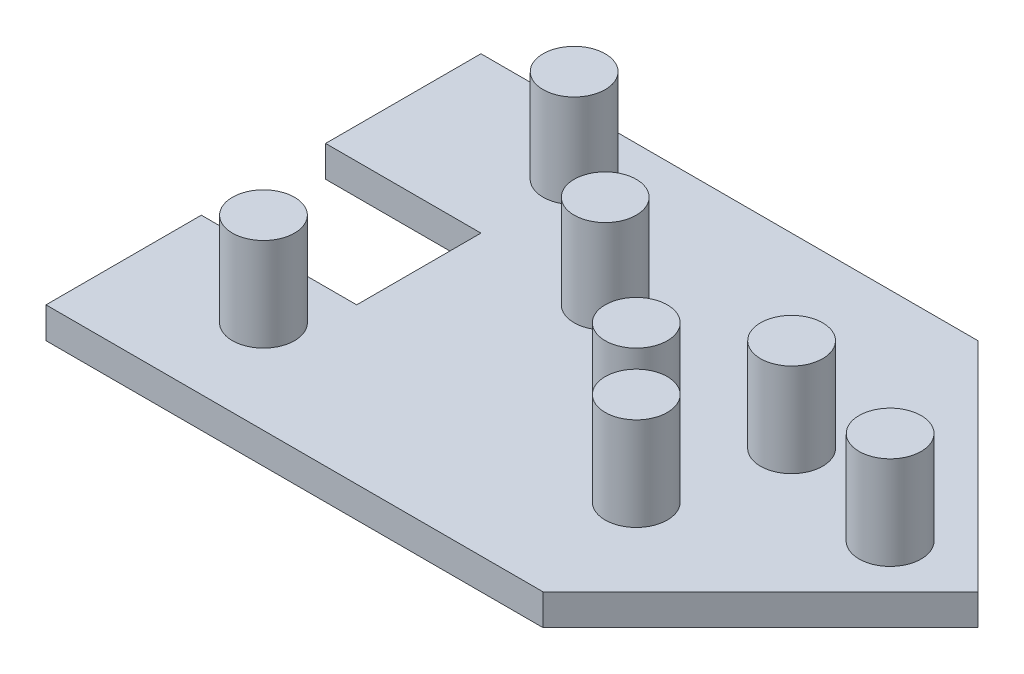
ISO-10303-21;
HEADER;
FILE_DESCRIPTION(('STEP AP214'),'2;1');
FILE_NAME('part.step','',(''),(''),'','','');
FILE_SCHEMA(('AUTOMOTIVE_DESIGN { 1 0 10303 214 1 1 1 1 }'));
ENDSEC;
DATA;
#1=APPLICATION_CONTEXT('core data for automotive mechanical design processes');
#2=APPLICATION_PROTOCOL_DEFINITION('international standard','automotive_design',2000,#1);
#3=PRODUCT_CONTEXT('',#1,'mechanical');
#4=PRODUCT('Part','Part','',(#3));
#5=PRODUCT_RELATED_PRODUCT_CATEGORY('part','',(#4));
#6=PRODUCT_DEFINITION_FORMATION('','',#4);
#7=PRODUCT_DEFINITION_CONTEXT('part definition',#1,'design');
#8=PRODUCT_DEFINITION('design','',#6,#7);
#9=PRODUCT_DEFINITION_SHAPE('','',#8);
#10=(LENGTH_UNIT() NAMED_UNIT(*) SI_UNIT(.MILLI.,.METRE.));
#11=(NAMED_UNIT(*) PLANE_ANGLE_UNIT() SI_UNIT($,.RADIAN.));
#12=(NAMED_UNIT(*) SI_UNIT($,.STERADIAN.) SOLID_ANGLE_UNIT());
#13=UNCERTAINTY_MEASURE_WITH_UNIT(LENGTH_MEASURE(1.E-05),#10,'distance_accuracy_value','');
#14=(GEOMETRIC_REPRESENTATION_CONTEXT(3) GLOBAL_UNCERTAINTY_ASSIGNED_CONTEXT((#13)) GLOBAL_UNIT_ASSIGNED_CONTEXT((#10,
#11,#12)) REPRESENTATION_CONTEXT('',''));
#15=CARTESIAN_POINT('',(0.,0.,0.));
#16=DIRECTION('',(0.,0.,1.));
#17=DIRECTION('',(1.,0.,0.));
#18=AXIS2_PLACEMENT_3D('',#15,#16,#17);
#19=CARTESIAN_POINT('',(0.,5.,0.));
#20=DIRECTION('',(0.,1.,0.));
#21=DIRECTION('',(0.,0.,1.));
#22=AXIS2_PLACEMENT_3D('',#19,#20,#21);
#23=PLANE('',#22);
#24=CARTESIAN_POINT('',(75.,5.,-20.));
#25=DIRECTION('',(0.,1.,0.));
#26=DIRECTION('',(0.,0.,1.));
#27=AXIS2_PLACEMENT_3D('',#24,#25,#26);
#28=CIRCLE('',#27,5.00000000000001);
#29=CARTESIAN_POINT('',(75.,5.,-15.));
#30=VERTEX_POINT('',#29);
#31=EDGE_CURVE('E281',#30,#30,#28,.T.);
#32=ORIENTED_EDGE('',*,*,#31,.F.);
#33=EDGE_LOOP('',(#32));
#34=FACE_BOUND('',#33,.T.);
#35=CARTESIAN_POINT('',(25.,5.,-60.));
#36=DIRECTION('',(0.,1.,0.));
#37=DIRECTION('',(0.,0.,1.));
#38=AXIS2_PLACEMENT_3D('',#35,#36,#37);
#39=CIRCLE('',#38,5.00000000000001);
#40=CARTESIAN_POINT('',(25.,5.,-55.));
#41=VERTEX_POINT('',#40);
#42=EDGE_CURVE('E298',#41,#41,#39,.T.);
#43=ORIENTED_EDGE('',*,*,#42,.F.);
#44=EDGE_LOOP('',(#43));
#45=FACE_BOUND('',#44,.T.);
#46=CARTESIAN_POINT('',(80.,5.,-40.));
#47=DIRECTION('',(0.,1.,0.));
#48=DIRECTION('',(0.,0.,1.));
#49=AXIS2_PLACEMENT_3D('',#46,#47,#48);
#50=CIRCLE('',#49,5.00000000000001);
#51=CARTESIAN_POINT('',(80.,5.,-35.));
#52=VERTEX_POINT('',#51);
#53=EDGE_CURVE('E310',#52,#52,#50,.T.);
#54=ORIENTED_EDGE('',*,*,#53,.F.);
#55=EDGE_LOOP('',(#54));
#56=FACE_BOUND('',#55,.T.);
#57=DIRECTION('',(0.,0.,1.));
#58=VECTOR('',#57,1.);
#59=CARTESIAN_POINT('',(0.,5.,-25.));
#60=LINE('',#59,#58);
#61=CARTESIAN_POINT('',(0.,5.,-25.));
#62=VERTEX_POINT('',#61);
#63=CARTESIAN_POINT('',(0.,5.,0.));
#64=VERTEX_POINT('',#63);
#65=EDGE_CURVE('E142',#62,#64,#60,.T.);
#66=ORIENTED_EDGE('',*,*,#65,.T.);
#67=DIRECTION('',(1.,0.,0.));
#68=VECTOR('',#67,1.);
#69=CARTESIAN_POINT('',(0.,5.,0.));
#70=LINE('',#69,#68);
#71=CARTESIAN_POINT('',(80.,5.,0.));
#72=VERTEX_POINT('',#71);
#73=EDGE_CURVE('E117',#64,#72,#70,.T.);
#74=ORIENTED_EDGE('',*,*,#73,.T.);
#75=DIRECTION('',(0.707106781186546,0.,-0.707106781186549));
#76=VECTOR('',#75,1.);
#77=CARTESIAN_POINT('',(80.,5.,0.));
#78=LINE('',#77,#76);
#79=CARTESIAN_POINT('',(115.,5.,-35.0000000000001));
#80=VERTEX_POINT('',#79);
#81=EDGE_CURVE('E145',#72,#80,#78,.T.);
#82=ORIENTED_EDGE('',*,*,#81,.T.);
#83=DIRECTION('',(-0.707106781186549,0.,-0.707106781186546));
#84=VECTOR('',#83,1.);
#85=CARTESIAN_POINT('',(115.,5.,-35.0000000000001));
#86=LINE('',#85,#84);
#87=CARTESIAN_POINT('',(80.,5.,-70.));
#88=VERTEX_POINT('',#87);
#89=EDGE_CURVE('E147',#80,#88,#86,.T.);
#90=ORIENTED_EDGE('',*,*,#89,.T.);
#91=DIRECTION('',(-1.,0.,0.));
#92=VECTOR('',#91,1.);
#93=CARTESIAN_POINT('',(80.,5.,-70.));
#94=LINE('',#93,#92);
#95=CARTESIAN_POINT('',(0.,5.,-70.));
#96=VERTEX_POINT('',#95);
#97=EDGE_CURVE('E149',#88,#96,#94,.T.);
#98=ORIENTED_EDGE('',*,*,#97,.T.);
#99=DIRECTION('',(0.,0.,1.));
#100=VECTOR('',#99,1.);
#101=CARTESIAN_POINT('',(0.,5.,-70.));
#102=LINE('',#101,#100);
#103=CARTESIAN_POINT('',(0.,5.,-45.));
#104=VERTEX_POINT('',#103);
#105=EDGE_CURVE('E151',#96,#104,#102,.T.);
#106=ORIENTED_EDGE('',*,*,#105,.T.);
#107=DIRECTION('',(1.,0.,0.));
#108=VECTOR('',#107,1.);
#109=CARTESIAN_POINT('',(0.,5.,-45.));
#110=LINE('',#109,#108);
#111=CARTESIAN_POINT('',(25.,5.,-45.));
#112=VERTEX_POINT('',#111);
#113=EDGE_CURVE('E153',#104,#112,#110,.T.);
#114=ORIENTED_EDGE('',*,*,#113,.T.);
#115=DIRECTION('',(0.,0.,1.));
#116=VECTOR('',#115,1.);
#117=CARTESIAN_POINT('',(25.,5.,-45.));
#118=LINE('',#117,#116);
#119=CARTESIAN_POINT('',(25.,5.,-25.));
#120=VERTEX_POINT('',#119);
#121=EDGE_CURVE('E53',#112,#120,#118,.T.);
#122=ORIENTED_EDGE('',*,*,#121,.T.);
#123=DIRECTION('',(-1.,0.,0.));
#124=VECTOR('',#123,1.);
#125=CARTESIAN_POINT('',(25.,5.,-25.));
#126=LINE('',#125,#124);
#127=EDGE_CURVE('E48',#120,#62,#126,.T.);
#128=ORIENTED_EDGE('',*,*,#127,.T.);
#129=EDGE_LOOP('',(#66,#74,#82,#90,#98,#106,#114,#122,#128));
#130=FACE_BOUND('',#129,.T.);
#131=CARTESIAN_POINT('',(100.857864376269,5.,-35.0000000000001));
#132=DIRECTION('',(0.,1.,0.));
#133=DIRECTION('',(0.,0.,1.));
#134=AXIS2_PLACEMENT_3D('',#131,#132,#133);
#135=CIRCLE('',#134,5.00000000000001);
#136=CARTESIAN_POINT('',(100.857864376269,5.,-30.0000000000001));
#137=VERTEX_POINT('',#136);
#138=EDGE_CURVE('E125',#137,#137,#135,.T.);
#139=ORIENTED_EDGE('',*,*,#138,.F.);
#140=EDGE_LOOP('',(#139));
#141=FACE_BOUND('',#140,.T.);
#142=CARTESIAN_POINT('',(45.,5.,-45.));
#143=DIRECTION('',(0.,1.,0.));
#144=DIRECTION('',(0.,0.,1.));
#145=AXIS2_PLACEMENT_3D('',#142,#143,#144);
#146=CIRCLE('',#145,5.00000000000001);
#147=CARTESIAN_POINT('',(45.,5.,-40.));
#148=VERTEX_POINT('',#147);
#149=EDGE_CURVE('E304',#148,#148,#146,.T.);
#150=ORIENTED_EDGE('',*,*,#149,.F.);
#151=EDGE_LOOP('',(#150));
#152=FACE_BOUND('',#151,.T.);
#153=CARTESIAN_POINT('',(20.,5.,-15.));
#154=DIRECTION('',(0.,1.,0.));
#155=DIRECTION('',(0.,0.,1.));
#156=AXIS2_PLACEMENT_3D('',#153,#154,#155);
#157=CIRCLE('',#156,5.00000000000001);
#158=CARTESIAN_POINT('',(20.,5.,-9.99999999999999));
#159=VERTEX_POINT('',#158);
#160=EDGE_CURVE('E292',#159,#159,#157,.T.);
#161=ORIENTED_EDGE('',*,*,#160,.F.);
#162=EDGE_LOOP('',(#161));
#163=FACE_BOUND('',#162,.T.);
#164=CARTESIAN_POINT('',(65.,5.,-30.));
#165=DIRECTION('',(0.,1.,0.));
#166=DIRECTION('',(0.,0.,1.));
#167=AXIS2_PLACEMENT_3D('',#164,#165,#166);
#168=CIRCLE('',#167,5.00000000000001);
#169=CARTESIAN_POINT('',(65.,5.,-25.));
#170=VERTEX_POINT('',#169);
#171=EDGE_CURVE('E282',#170,#170,#168,.T.);
#172=ORIENTED_EDGE('',*,*,#171,.F.);
#173=EDGE_LOOP('',(#172));
#174=FACE_BOUND('',#173,.T.);
#175=ADVANCED_FACE('F33',(#34,#45,#56,#130,#141,#152,#163,#174),#23,.T.);
#176=CARTESIAN_POINT('',(0.,5.,-25.));
#177=DIRECTION('',(1.,0.,0.));
#178=DIRECTION('',(0.,0.,-1.));
#179=AXIS2_PLACEMENT_3D('',#176,#177,#178);
#180=PLANE('',#179);
#181=DIRECTION('',(0.,0.,1.));
#182=VECTOR('',#181,1.);
#183=CARTESIAN_POINT('',(0.,0.,-25.));
#184=LINE('',#183,#182);
#185=CARTESIAN_POINT('',(0.,0.,-25.));
#186=VERTEX_POINT('',#185);
#187=CARTESIAN_POINT('',(0.,0.,0.));
#188=VERTEX_POINT('',#187);
#189=EDGE_CURVE('E108',#186,#188,#184,.T.);
#190=ORIENTED_EDGE('',*,*,#189,.T.);
#191=DIRECTION('',(0.,-1.,0.));
#192=VECTOR('',#191,1.);
#193=CARTESIAN_POINT('',(0.,5.,0.));
#194=LINE('',#193,#192);
#195=EDGE_CURVE('E11',#64,#188,#194,.T.);
#196=ORIENTED_EDGE('',*,*,#195,.F.);
#197=ORIENTED_EDGE('',*,*,#65,.F.);
#198=DIRECTION('',(0.,-1.,0.));
#199=VECTOR('',#198,1.);
#200=CARTESIAN_POINT('',(0.,5.,-25.));
#201=LINE('',#200,#199);
#202=EDGE_CURVE('E121',#62,#186,#201,.T.);
#203=ORIENTED_EDGE('',*,*,#202,.T.);
#204=EDGE_LOOP('',(#190,#196,#197,#203));
#205=FACE_BOUND('',#204,.T.);
#206=ADVANCED_FACE('F35',(#205),#180,.F.);
#207=CARTESIAN_POINT('',(0.,5.,0.));
#208=DIRECTION('',(0.,0.,-1.));
#209=DIRECTION('',(-1.,0.,0.));
#210=AXIS2_PLACEMENT_3D('',#207,#208,#209);
#211=PLANE('',#210);
#212=DIRECTION('',(1.,0.,0.));
#213=VECTOR('',#212,1.);
#214=CARTESIAN_POINT('',(0.,0.,0.));
#215=LINE('',#214,#213);
#216=CARTESIAN_POINT('',(80.,0.,0.));
#217=VERTEX_POINT('',#216);
#218=EDGE_CURVE('E104',#188,#217,#215,.T.);
#219=ORIENTED_EDGE('',*,*,#218,.T.);
#220=DIRECTION('',(0.,-1.,0.));
#221=VECTOR('',#220,1.);
#222=CARTESIAN_POINT('',(80.,5.,0.));
#223=LINE('',#222,#221);
#224=EDGE_CURVE('E41',#72,#217,#223,.T.);
#225=ORIENTED_EDGE('',*,*,#224,.F.);
#226=ORIENTED_EDGE('',*,*,#73,.F.);
#227=ORIENTED_EDGE('',*,*,#195,.T.);
#228=EDGE_LOOP('',(#219,#225,#226,#227));
#229=FACE_BOUND('',#228,.T.);
#230=ADVANCED_FACE('F116',(#229),#211,.F.);
#231=CARTESIAN_POINT('',(80.,5.,0.));
#232=DIRECTION('',(-0.707106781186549,0.,-0.707106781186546));
#233=DIRECTION('',(-0.707106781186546,0.,0.707106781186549));
#234=AXIS2_PLACEMENT_3D('',#231,#232,#233);
#235=PLANE('',#234);
#236=DIRECTION('',(0.707106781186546,0.,-0.707106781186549));
#237=VECTOR('',#236,1.);
#238=CARTESIAN_POINT('',(80.,0.,0.));
#239=LINE('',#238,#237);
#240=CARTESIAN_POINT('',(115.,0.,-35.0000000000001));
#241=VERTEX_POINT('',#240);
#242=EDGE_CURVE('E110',#217,#241,#239,.T.);
#243=ORIENTED_EDGE('',*,*,#242,.T.);
#244=DIRECTION('',(0.,-1.,0.));
#245=VECTOR('',#244,1.);
#246=CARTESIAN_POINT('',(115.,5.,-35.0000000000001));
#247=LINE('',#246,#245);
#248=EDGE_CURVE('E173',#80,#241,#247,.T.);
#249=ORIENTED_EDGE('',*,*,#248,.F.);
#250=ORIENTED_EDGE('',*,*,#81,.F.);
#251=ORIENTED_EDGE('',*,*,#224,.T.);
#252=EDGE_LOOP('',(#243,#249,#250,#251));
#253=FACE_BOUND('',#252,.T.);
#254=ADVANCED_FACE('F177',(#253),#235,.F.);
#255=CARTESIAN_POINT('',(115.,5.,-35.0000000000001));
#256=DIRECTION('',(-0.707106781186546,0.,0.707106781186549));
#257=DIRECTION('',(0.707106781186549,0.,0.707106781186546));
#258=AXIS2_PLACEMENT_3D('',#255,#256,#257);
#259=PLANE('',#258);
#260=DIRECTION('',(-0.707106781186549,0.,-0.707106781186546));
#261=VECTOR('',#260,1.);
#262=CARTESIAN_POINT('',(115.,0.,-35.0000000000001));
#263=LINE('',#262,#261);
#264=CARTESIAN_POINT('',(80.,0.,-70.));
#265=VERTEX_POINT('',#264);
#266=EDGE_CURVE('E130',#241,#265,#263,.T.);
#267=ORIENTED_EDGE('',*,*,#266,.T.);
#268=DIRECTION('',(0.,-1.,0.));
#269=VECTOR('',#268,1.);
#270=CARTESIAN_POINT('',(80.,5.,-70.));
#271=LINE('',#270,#269);
#272=EDGE_CURVE('E170',#88,#265,#271,.T.);
#273=ORIENTED_EDGE('',*,*,#272,.F.);
#274=ORIENTED_EDGE('',*,*,#89,.F.);
#275=ORIENTED_EDGE('',*,*,#248,.T.);
#276=EDGE_LOOP('',(#267,#273,#274,#275));
#277=FACE_BOUND('',#276,.T.);
#278=ADVANCED_FACE('F185',(#277),#259,.F.);
#279=CARTESIAN_POINT('',(80.,5.,-70.));
#280=DIRECTION('',(0.,0.,1.));
#281=DIRECTION('',(1.,0.,0.));
#282=AXIS2_PLACEMENT_3D('',#279,#280,#281);
#283=PLANE('',#282);
#284=DIRECTION('',(-1.,0.,0.));
#285=VECTOR('',#284,1.);
#286=CARTESIAN_POINT('',(80.,0.,-70.));
#287=LINE('',#286,#285);
#288=CARTESIAN_POINT('',(0.,0.,-70.));
#289=VERTEX_POINT('',#288);
#290=EDGE_CURVE('E132',#265,#289,#287,.T.);
#291=ORIENTED_EDGE('',*,*,#290,.T.);
#292=DIRECTION('',(0.,-1.,0.));
#293=VECTOR('',#292,1.);
#294=CARTESIAN_POINT('',(0.,5.,-70.));
#295=LINE('',#294,#293);
#296=EDGE_CURVE('E167',#96,#289,#295,.T.);
#297=ORIENTED_EDGE('',*,*,#296,.F.);
#298=ORIENTED_EDGE('',*,*,#97,.F.);
#299=ORIENTED_EDGE('',*,*,#272,.T.);
#300=EDGE_LOOP('',(#291,#297,#298,#299));
#301=FACE_BOUND('',#300,.T.);
#302=ADVANCED_FACE('F188',(#301),#283,.F.);
#303=CARTESIAN_POINT('',(0.,5.,-70.));
#304=DIRECTION('',(1.,0.,0.));
#305=DIRECTION('',(0.,0.,-1.));
#306=AXIS2_PLACEMENT_3D('',#303,#304,#305);
#307=PLANE('',#306);
#308=DIRECTION('',(0.,0.,1.));
#309=VECTOR('',#308,1.);
#310=CARTESIAN_POINT('',(0.,0.,-70.));
#311=LINE('',#310,#309);
#312=CARTESIAN_POINT('',(0.,0.,-45.));
#313=VERTEX_POINT('',#312);
#314=EDGE_CURVE('E134',#289,#313,#311,.T.);
#315=ORIENTED_EDGE('',*,*,#314,.T.);
#316=DIRECTION('',(0.,-1.,0.));
#317=VECTOR('',#316,1.);
#318=CARTESIAN_POINT('',(0.,5.,-45.));
#319=LINE('',#318,#317);
#320=EDGE_CURVE('E164',#104,#313,#319,.T.);
#321=ORIENTED_EDGE('',*,*,#320,.F.);
#322=ORIENTED_EDGE('',*,*,#105,.F.);
#323=ORIENTED_EDGE('',*,*,#296,.T.);
#324=EDGE_LOOP('',(#315,#321,#322,#323));
#325=FACE_BOUND('',#324,.T.);
#326=ADVANCED_FACE('F193',(#325),#307,.F.);
#327=CARTESIAN_POINT('',(0.,5.,-45.));
#328=DIRECTION('',(0.,0.,-1.));
#329=DIRECTION('',(-1.,0.,0.));
#330=AXIS2_PLACEMENT_3D('',#327,#328,#329);
#331=PLANE('',#330);
#332=DIRECTION('',(1.,0.,0.));
#333=VECTOR('',#332,1.);
#334=CARTESIAN_POINT('',(0.,0.,-45.));
#335=LINE('',#334,#333);
#336=CARTESIAN_POINT('',(25.,0.,-45.));
#337=VERTEX_POINT('',#336);
#338=EDGE_CURVE('E136',#313,#337,#335,.T.);
#339=ORIENTED_EDGE('',*,*,#338,.T.);
#340=DIRECTION('',(0.,-1.,0.));
#341=VECTOR('',#340,1.);
#342=CARTESIAN_POINT('',(25.,5.,-45.));
#343=LINE('',#342,#341);
#344=EDGE_CURVE('E161',#112,#337,#343,.T.);
#345=ORIENTED_EDGE('',*,*,#344,.F.);
#346=ORIENTED_EDGE('',*,*,#113,.F.);
#347=ORIENTED_EDGE('',*,*,#320,.T.);
#348=EDGE_LOOP('',(#339,#345,#346,#347));
#349=FACE_BOUND('',#348,.T.);
#350=ADVANCED_FACE('F197',(#349),#331,.F.);
#351=CARTESIAN_POINT('',(25.,5.,-45.));
#352=DIRECTION('',(1.,0.,0.));
#353=DIRECTION('',(0.,0.,-1.));
#354=AXIS2_PLACEMENT_3D('',#351,#352,#353);
#355=PLANE('',#354);
#356=DIRECTION('',(0.,0.,1.));
#357=VECTOR('',#356,1.);
#358=CARTESIAN_POINT('',(25.,0.,-45.));
#359=LINE('',#358,#357);
#360=CARTESIAN_POINT('',(25.,0.,-25.));
#361=VERTEX_POINT('',#360);
#362=EDGE_CURVE('E138',#337,#361,#359,.T.);
#363=ORIENTED_EDGE('',*,*,#362,.T.);
#364=DIRECTION('',(0.,-1.,0.));
#365=VECTOR('',#364,1.);
#366=CARTESIAN_POINT('',(25.,5.,-25.));
#367=LINE('',#366,#365);
#368=EDGE_CURVE('E158',#120,#361,#367,.T.);
#369=ORIENTED_EDGE('',*,*,#368,.F.);
#370=ORIENTED_EDGE('',*,*,#121,.F.);
#371=ORIENTED_EDGE('',*,*,#344,.T.);
#372=EDGE_LOOP('',(#363,#369,#370,#371));
#373=FACE_BOUND('',#372,.T.);
#374=ADVANCED_FACE('F201',(#373),#355,.F.);
#375=CARTESIAN_POINT('',(25.,5.,-25.));
#376=DIRECTION('',(0.,0.,1.));
#377=DIRECTION('',(1.,0.,0.));
#378=AXIS2_PLACEMENT_3D('',#375,#376,#377);
#379=PLANE('',#378);
#380=DIRECTION('',(-1.,0.,0.));
#381=VECTOR('',#380,1.);
#382=CARTESIAN_POINT('',(25.,0.,-25.));
#383=LINE('',#382,#381);
#384=EDGE_CURVE('E140',#361,#186,#383,.T.);
#385=ORIENTED_EDGE('',*,*,#384,.T.);
#386=ORIENTED_EDGE('',*,*,#202,.F.);
#387=ORIENTED_EDGE('',*,*,#127,.F.);
#388=ORIENTED_EDGE('',*,*,#368,.T.);
#389=EDGE_LOOP('',(#385,#386,#387,#388));
#390=FACE_BOUND('',#389,.T.);
#391=ADVANCED_FACE('F203',(#390),#379,.F.);
#392=CARTESIAN_POINT('',(0.,0.,0.));
#393=DIRECTION('',(0.,1.,0.));
#394=DIRECTION('',(0.,0.,1.));
#395=AXIS2_PLACEMENT_3D('',#392,#393,#394);
#396=PLANE('',#395);
#397=ORIENTED_EDGE('',*,*,#189,.F.);
#398=ORIENTED_EDGE('',*,*,#384,.F.);
#399=ORIENTED_EDGE('',*,*,#362,.F.);
#400=ORIENTED_EDGE('',*,*,#338,.F.);
#401=ORIENTED_EDGE('',*,*,#314,.F.);
#402=ORIENTED_EDGE('',*,*,#290,.F.);
#403=ORIENTED_EDGE('',*,*,#266,.F.);
#404=ORIENTED_EDGE('',*,*,#242,.F.);
#405=ORIENTED_EDGE('',*,*,#218,.F.);
#406=EDGE_LOOP('',(#397,#398,#399,#400,#401,#402,#403,#404,#405));
#407=FACE_BOUND('',#406,.T.);
#408=ADVANCED_FACE('F105',(#407),#396,.F.);
#409=CARTESIAN_POINT('',(100.857864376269,20.,-35.0000000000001));
#410=DIRECTION('',(0.,-1.,0.));
#411=DIRECTION('',(0.,0.,-1.));
#412=AXIS2_PLACEMENT_3D('',#409,#410,#411);
#413=CYLINDRICAL_SURFACE('',#412,5.00000000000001);
#414=CARTESIAN_POINT('',(100.857864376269,20.,-35.0000000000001));
#415=DIRECTION('',(0.,1.,0.));
#416=DIRECTION('',(0.,0.,1.));
#417=AXIS2_PLACEMENT_3D('',#414,#415,#416);
#418=CIRCLE('',#417,5.00000000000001);
#419=CARTESIAN_POINT('',(100.857864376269,20.,-30.0000000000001));
#420=VERTEX_POINT('',#419);
#421=EDGE_CURVE('E122',#420,#420,#418,.T.);
#422=ORIENTED_EDGE('',*,*,#421,.F.);
#423=EDGE_LOOP('',(#422));
#424=FACE_BOUND('',#423,.T.);
#425=ORIENTED_EDGE('',*,*,#138,.T.);
#426=EDGE_LOOP('',(#425));
#427=FACE_BOUND('',#426,.T.);
#428=ADVANCED_FACE('F210',(#424,#427),#413,.T.);
#429=CARTESIAN_POINT('',(100.857864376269,20.,-35.0000000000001));
#430=DIRECTION('',(0.,1.,0.));
#431=DIRECTION('',(0.,0.,1.));
#432=AXIS2_PLACEMENT_3D('',#429,#430,#431);
#433=PLANE('',#432);
#434=ORIENTED_EDGE('',*,*,#421,.T.);
#435=EDGE_LOOP('',(#434));
#436=FACE_BOUND('',#435,.T.);
#437=ADVANCED_FACE('F224',(#436),#433,.T.);
#438=CARTESIAN_POINT('',(80.,20.,-40.));
#439=DIRECTION('',(0.,-1.,0.));
#440=DIRECTION('',(0.,0.,-1.));
#441=AXIS2_PLACEMENT_3D('',#438,#439,#440);
#442=CYLINDRICAL_SURFACE('',#441,5.00000000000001);
#443=CARTESIAN_POINT('',(80.,20.,-40.));
#444=DIRECTION('',(0.,1.,0.));
#445=DIRECTION('',(0.,0.,1.));
#446=AXIS2_PLACEMENT_3D('',#443,#444,#445);
#447=CIRCLE('',#446,5.00000000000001);
#448=CARTESIAN_POINT('',(80.,20.,-35.));
#449=VERTEX_POINT('',#448);
#450=EDGE_CURVE('E313',#449,#449,#447,.T.);
#451=ORIENTED_EDGE('',*,*,#450,.F.);
#452=EDGE_LOOP('',(#451));
#453=FACE_BOUND('',#452,.T.);
#454=ORIENTED_EDGE('',*,*,#53,.T.);
#455=EDGE_LOOP('',(#454));
#456=FACE_BOUND('',#455,.T.);
#457=ADVANCED_FACE('F228',(#453,#456),#442,.T.);
#458=CARTESIAN_POINT('',(80.,20.,-40.));
#459=DIRECTION('',(0.,1.,0.));
#460=DIRECTION('',(0.,0.,1.));
#461=AXIS2_PLACEMENT_3D('',#458,#459,#460);
#462=PLANE('',#461);
#463=ORIENTED_EDGE('',*,*,#450,.T.);
#464=EDGE_LOOP('',(#463));
#465=FACE_BOUND('',#464,.T.);
#466=ADVANCED_FACE('F232',(#465),#462,.T.);
#467=CARTESIAN_POINT('',(45.,20.,-45.));
#468=DIRECTION('',(0.,-1.,0.));
#469=DIRECTION('',(0.,0.,-1.));
#470=AXIS2_PLACEMENT_3D('',#467,#468,#469);
#471=CYLINDRICAL_SURFACE('',#470,5.00000000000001);
#472=CARTESIAN_POINT('',(45.,20.,-45.));
#473=DIRECTION('',(0.,1.,0.));
#474=DIRECTION('',(0.,0.,1.));
#475=AXIS2_PLACEMENT_3D('',#472,#473,#474);
#476=CIRCLE('',#475,5.00000000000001);
#477=CARTESIAN_POINT('',(45.,20.,-40.));
#478=VERTEX_POINT('',#477);
#479=EDGE_CURVE('E307',#478,#478,#476,.T.);
#480=ORIENTED_EDGE('',*,*,#479,.F.);
#481=EDGE_LOOP('',(#480));
#482=FACE_BOUND('',#481,.T.);
#483=ORIENTED_EDGE('',*,*,#149,.T.);
#484=EDGE_LOOP('',(#483));
#485=FACE_BOUND('',#484,.T.);
#486=ADVANCED_FACE('F236',(#482,#485),#471,.T.);
#487=CARTESIAN_POINT('',(45.,20.,-45.));
#488=DIRECTION('',(0.,1.,0.));
#489=DIRECTION('',(0.,0.,1.));
#490=AXIS2_PLACEMENT_3D('',#487,#488,#489);
#491=PLANE('',#490);
#492=ORIENTED_EDGE('',*,*,#479,.T.);
#493=EDGE_LOOP('',(#492));
#494=FACE_BOUND('',#493,.T.);
#495=ADVANCED_FACE('F240',(#494),#491,.T.);
#496=CARTESIAN_POINT('',(25.,20.,-60.));
#497=DIRECTION('',(0.,-1.,0.));
#498=DIRECTION('',(0.,0.,-1.));
#499=AXIS2_PLACEMENT_3D('',#496,#497,#498);
#500=CYLINDRICAL_SURFACE('',#499,5.00000000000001);
#501=CARTESIAN_POINT('',(25.,20.,-60.));
#502=DIRECTION('',(0.,1.,0.));
#503=DIRECTION('',(0.,0.,1.));
#504=AXIS2_PLACEMENT_3D('',#501,#502,#503);
#505=CIRCLE('',#504,5.00000000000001);
#506=CARTESIAN_POINT('',(25.,20.,-55.));
#507=VERTEX_POINT('',#506);
#508=EDGE_CURVE('E301',#507,#507,#505,.T.);
#509=ORIENTED_EDGE('',*,*,#508,.F.);
#510=EDGE_LOOP('',(#509));
#511=FACE_BOUND('',#510,.T.);
#512=ORIENTED_EDGE('',*,*,#42,.T.);
#513=EDGE_LOOP('',(#512));
#514=FACE_BOUND('',#513,.T.);
#515=ADVANCED_FACE('F244',(#511,#514),#500,.T.);
#516=CARTESIAN_POINT('',(25.,20.,-60.));
#517=DIRECTION('',(0.,1.,0.));
#518=DIRECTION('',(0.,0.,1.));
#519=AXIS2_PLACEMENT_3D('',#516,#517,#518);
#520=PLANE('',#519);
#521=ORIENTED_EDGE('',*,*,#508,.T.);
#522=EDGE_LOOP('',(#521));
#523=FACE_BOUND('',#522,.T.);
#524=ADVANCED_FACE('F248',(#523),#520,.T.);
#525=CARTESIAN_POINT('',(20.,20.,-15.));
#526=DIRECTION('',(0.,-1.,0.));
#527=DIRECTION('',(0.,0.,-1.));
#528=AXIS2_PLACEMENT_3D('',#525,#526,#527);
#529=CYLINDRICAL_SURFACE('',#528,5.00000000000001);
#530=CARTESIAN_POINT('',(20.,20.,-15.));
#531=DIRECTION('',(0.,1.,0.));
#532=DIRECTION('',(0.,0.,1.));
#533=AXIS2_PLACEMENT_3D('',#530,#531,#532);
#534=CIRCLE('',#533,5.00000000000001);
#535=CARTESIAN_POINT('',(20.,20.,-9.99999999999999));
#536=VERTEX_POINT('',#535);
#537=EDGE_CURVE('E295',#536,#536,#534,.T.);
#538=ORIENTED_EDGE('',*,*,#537,.F.);
#539=EDGE_LOOP('',(#538));
#540=FACE_BOUND('',#539,.T.);
#541=ORIENTED_EDGE('',*,*,#160,.T.);
#542=EDGE_LOOP('',(#541));
#543=FACE_BOUND('',#542,.T.);
#544=ADVANCED_FACE('F252',(#540,#543),#529,.T.);
#545=CARTESIAN_POINT('',(20.,20.,-15.));
#546=DIRECTION('',(0.,1.,0.));
#547=DIRECTION('',(0.,0.,1.));
#548=AXIS2_PLACEMENT_3D('',#545,#546,#547);
#549=PLANE('',#548);
#550=ORIENTED_EDGE('',*,*,#537,.T.);
#551=EDGE_LOOP('',(#550));
#552=FACE_BOUND('',#551,.T.);
#553=ADVANCED_FACE('F256',(#552),#549,.T.);
#554=CARTESIAN_POINT('',(75.,20.,-20.));
#555=DIRECTION('',(0.,-1.,0.));
#556=DIRECTION('',(0.,0.,-1.));
#557=AXIS2_PLACEMENT_3D('',#554,#555,#556);
#558=CYLINDRICAL_SURFACE('',#557,5.00000000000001);
#559=CARTESIAN_POINT('',(75.,20.,-20.));
#560=DIRECTION('',(0.,1.,0.));
#561=DIRECTION('',(0.,0.,1.));
#562=AXIS2_PLACEMENT_3D('',#559,#560,#561);
#563=CIRCLE('',#562,5.00000000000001);
#564=CARTESIAN_POINT('',(75.,20.,-15.));
#565=VERTEX_POINT('',#564);
#566=EDGE_CURVE('E285',#565,#565,#563,.T.);
#567=ORIENTED_EDGE('',*,*,#566,.F.);
#568=EDGE_LOOP('',(#567));
#569=FACE_BOUND('',#568,.T.);
#570=ORIENTED_EDGE('',*,*,#31,.T.);
#571=EDGE_LOOP('',(#570));
#572=FACE_BOUND('',#571,.T.);
#573=ADVANCED_FACE('F260',(#569,#572),#558,.T.);
#574=CARTESIAN_POINT('',(75.,20.,-20.));
#575=DIRECTION('',(0.,1.,0.));
#576=DIRECTION('',(0.,0.,1.));
#577=AXIS2_PLACEMENT_3D('',#574,#575,#576);
#578=PLANE('',#577);
#579=ORIENTED_EDGE('',*,*,#566,.T.);
#580=EDGE_LOOP('',(#579));
#581=FACE_BOUND('',#580,.T.);
#582=ADVANCED_FACE('F264',(#581),#578,.T.);
#583=CARTESIAN_POINT('',(65.,20.,-30.));
#584=DIRECTION('',(0.,-1.,0.));
#585=DIRECTION('',(0.,0.,-1.));
#586=AXIS2_PLACEMENT_3D('',#583,#584,#585);
#587=CYLINDRICAL_SURFACE('',#586,5.00000000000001);
#588=CARTESIAN_POINT('',(65.,20.,-30.));
#589=DIRECTION('',(0.,1.,0.));
#590=DIRECTION('',(0.,0.,1.));
#591=AXIS2_PLACEMENT_3D('',#588,#589,#590);
#592=CIRCLE('',#591,5.00000000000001);
#593=CARTESIAN_POINT('',(65.,20.,-25.));
#594=VERTEX_POINT('',#593);
#595=EDGE_CURVE('E280',#594,#594,#592,.T.);
#596=ORIENTED_EDGE('',*,*,#595,.F.);
#597=EDGE_LOOP('',(#596));
#598=FACE_BOUND('',#597,.T.);
#599=ORIENTED_EDGE('',*,*,#171,.T.);
#600=EDGE_LOOP('',(#599));
#601=FACE_BOUND('',#600,.T.);
#602=ADVANCED_FACE('F268',(#598,#601),#587,.T.);
#603=CARTESIAN_POINT('',(65.,20.,-30.));
#604=DIRECTION('',(0.,1.,0.));
#605=DIRECTION('',(0.,0.,1.));
#606=AXIS2_PLACEMENT_3D('',#603,#604,#605);
#607=PLANE('',#606);
#608=ORIENTED_EDGE('',*,*,#595,.T.);
#609=EDGE_LOOP('',(#608));
#610=FACE_BOUND('',#609,.T.);
#611=ADVANCED_FACE('F272',(#610),#607,.T.);
#612=CLOSED_SHELL('',(#175,#206,#230,#254,#278,#302,#326,#350,#374,#391,#408,#428,#437,#457,
#466,#486,#495,#515,#524,#544,#553,#573,#582,#602,#611));
#613=MANIFOLD_SOLID_BREP('B2',#612);
#614=ADVANCED_BREP_SHAPE_REPRESENTATION('',(#18,#613),#14);
#615=SHAPE_DEFINITION_REPRESENTATION(#9,#614);
ENDSEC;
END-ISO-10303-21;
